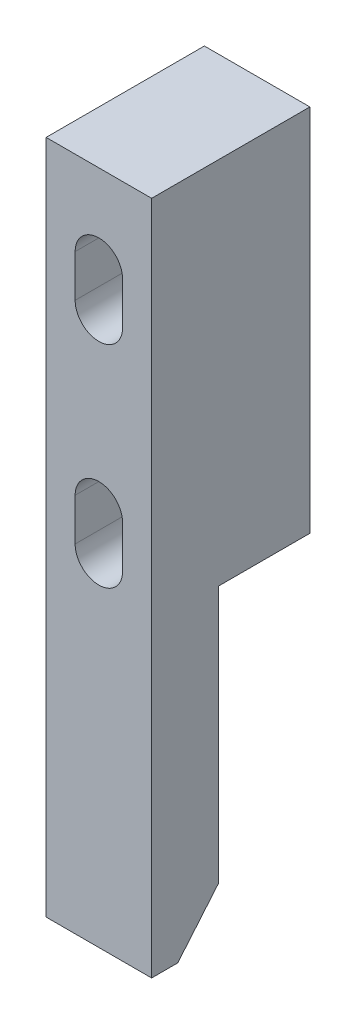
from build123d import *

# Parameters (mm, degrees)
SKETCH_2_W          = 10
SKETCH_2_H          = 64
EXTRUDE_1_DEPTH     = 15
SKETCH_3_OUTSIDE_W  = 30.298
SKETCH_3_OUTSIDE_H  = 79.298
CUT_EXTRUDE_1_DEPTH = 15


with BuildPart() as part:
    # Sketch 2 → Extrude 1 (new body)
    with BuildSketch(Plane.XY):
        with Locations((5, 32)):
            Rectangle(SKETCH_2_W, SKETCH_2_H)
        with BuildLine():
            Line((7.25, 32), (7.25, 36))
            ThreePointArc((7.25, 36), (5, 38.25), (2.75, 36))
            Line((2.75, 36), (2.75, 32))
            ThreePointArc((2.75, 32), (5, 29.75), (7.25, 32))
        make_face(mode=Mode.SUBTRACT)
        with BuildLine():
            Line((7.25, 52), (7.25, 56))
            ThreePointArc((7.25, 56), (5, 58.25), (2.75, 56))
            Line((2.75, 56), (2.75, 52))
            ThreePointArc((2.75, 52), (5, 49.75), (7.25, 52))
        make_face(mode=Mode.SUBTRACT)
    extrude(amount=EXTRUDE_1_DEPTH)

    # Sketch 3 outside → Cut-Extrude 1 (cut)
    with BuildSketch(Plane(origin=(10, 0, 0), x_dir=(0, 0, -1), z_dir=(1, 0, 0))):
        with Locations((-7.5, 32)):
            Rectangle(SKETCH_3_OUTSIDE_W, SKETCH_3_OUTSIDE_H)
        Polygon((-8.65, 4.616492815), (-8.65, 29), (0, 29), (0, 64), (-15, 64), (-15, 0), (-12.523697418, 0), align=None, mode=Mode.SUBTRACT)
    extrude(amount=-CUT_EXTRUDE_1_DEPTH, mode=Mode.SUBTRACT)


solid = part.part
